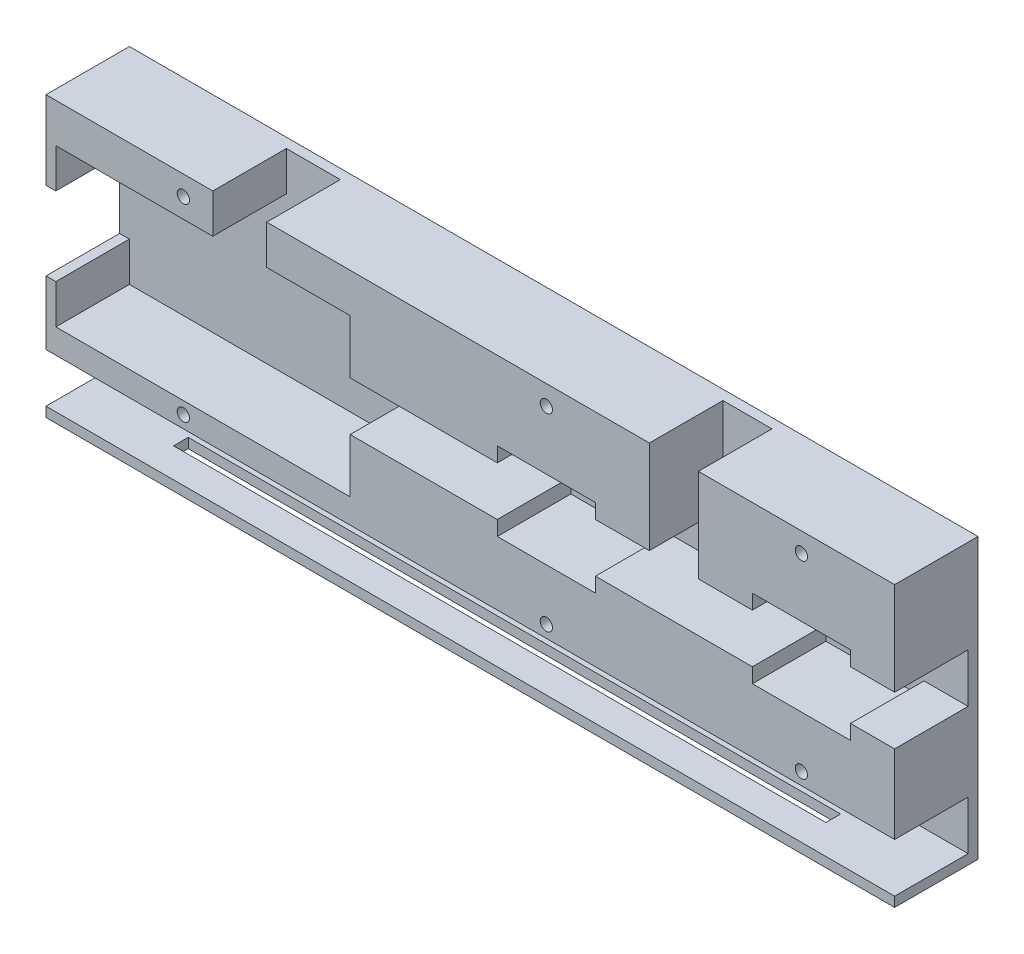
from build123d import *

# Parameters (mm, degrees)
SKETCH1_W             = 173
SKETCH1_H             = 2
BOSS_EXTRUDE5_DEPTH   = 15
BOSS_EXTRUDE5_2_DEPTH = 15
BOSS_EXTRUDE5_3_DEPTH = 15
BOSS_EXTRUDE5_4_DEPTH = 15
SKETCH4_W             = 173
SKETCH4_H             = 57
BOSS_EXTRUDE6_DEPTH   = 2
SKETCH5_R             = 1.25
CUT_EXTRUDE1_DEPTH    = 17
SKETCH6_R             = 1.25
CUT_EXTRUDE2_DEPTH    = 17
SKETCH7_W             = 2
SKETCH7_H             = 10
CUT_EXTRUDE4_DEPTH    = 15
SKETCH8_W             = 133
SKETCH8_H             = 3
CUT_EXTRUDE5_DEPTH    = 3


with BuildPart() as part:
    # Sketch1 → Boss-Extrude5 (new body)
    with BuildSketch(Plane.XY):
        with Locations((86.5, 1)):
            Rectangle(SKETCH1_W, SKETCH1_H)
    extrude(amount=BOSS_EXTRUDE5_DEPTH)



with BuildPart() as body_2:
    # Sketch1 → Boss-Extrude5 2 (new body)
    with BuildSketch(Plane.XY):
        Polygon((0, 12), (173, 12), (173, 57), (133, 57), (133, 49), (133, 38), (144, 38), (144, 41), (164, 41), (164, 38), (171, 38), (171, 28), (164, 28), (164, 25), (144, 25), (144, 28), (112, 28), (112, 25), (92, 25), (92, 28), (62, 28), (62, 17), (2, 17), (2, 25), (0, 25), align=None)
    extrude(amount=BOSS_EXTRUDE5_2_DEPTH)


with BuildPart() as body_3:
    # Sketch1 → Boss-Extrude5 3 (new body)
    with BuildSketch(Plane.XY):
        Polygon((0, 57), (0, 41), (2, 41), (2, 49), (34, 49), (34, 57), align=None)
    extrude(amount=BOSS_EXTRUDE5_3_DEPTH)


with BuildPart() as body_4:
    # Sketch1 → Boss-Extrude5 4 (new body)
    with BuildSketch(Plane.XY):
        Polygon((123, 57), (45, 57), (45, 49), (62, 49), (62, 38), (92, 38), (92, 41), (112, 41), (112, 38), (123, 38), align=None)
    extrude(amount=BOSS_EXTRUDE5_4_DEPTH)


with BuildPart() as part_1:
    add(part.part)

    add(body_2.part)  # Boss-Extrude6 merges body 2

    add(body_3.part)  # Boss-Extrude6 merges body 3

    add(body_4.part)  # Boss-Extrude6 merges body 4
    # Sketch4 → Boss-Extrude6 (add)
    with BuildSketch(Plane(origin=(0, 0, 0), x_dir=(-1, 0, 0), z_dir=(0, 0, -1))):
        with Locations((-86.5, 28.5)):
            Rectangle(SKETCH4_W, SKETCH4_H)
    extrude(amount=BOSS_EXTRUDE6_DEPTH)

    # Sketch5 → Cut-Extrude1 (cut)
    with BuildSketch(Plane.XY.offset(15)):
        with Locations((28, 53)):
            Circle(SKETCH5_R)
        with Locations((28, 14.5)):
            Circle(SKETCH5_R)
        with Locations((102, 53)):
            Circle(SKETCH5_R)
        with Locations((102, 14.5)):
            Circle(SKETCH5_R)
        with Locations((154, 14.5)):
            Circle(SKETCH5_R)
        with Locations((154, 53)):
            Circle(SKETCH5_R)
    extrude(amount=-CUT_EXTRUDE1_DEPTH, mode=Mode.SUBTRACT)

    # Sketch6 → Cut-Extrude2 (cut)
    with BuildSketch(Plane.XY):
        with Locations((46.170683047, 9.5)):
            Circle(SKETCH6_R)
        with Locations((63.029033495, 4.5)):
            Circle(SKETCH6_R)
        with Locations((99.170565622, 9.5)):
            Circle(SKETCH6_R)
        with Locations((112.564871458, 4.5)):
            Circle(SKETCH6_R)
        with Locations((161.869773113, 9.5)):
            Circle(SKETCH6_R)
        with Locations((146.281572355, 4.5)):
            Circle(SKETCH6_R)
    extrude(amount=-CUT_EXTRUDE2_DEPTH, mode=Mode.SUBTRACT)

    # Sketch7 → Cut-Extrude4 (cut)
    with BuildSketch(Plane.XY.offset(15)):
        with Locations((172, 33)):
            Rectangle(SKETCH7_W, SKETCH7_H)
    extrude(amount=-CUT_EXTRUDE4_DEPTH, mode=Mode.SUBTRACT)

    # Sketch8 → Cut-Extrude5 (cut)
    with BuildSketch(Plane.XZ):
        with Locations((86.5, 7.5)):
            Rectangle(SKETCH8_W, SKETCH8_H)
    extrude(amount=-CUT_EXTRUDE5_DEPTH, mode=Mode.SUBTRACT)


solid = part_1.part
